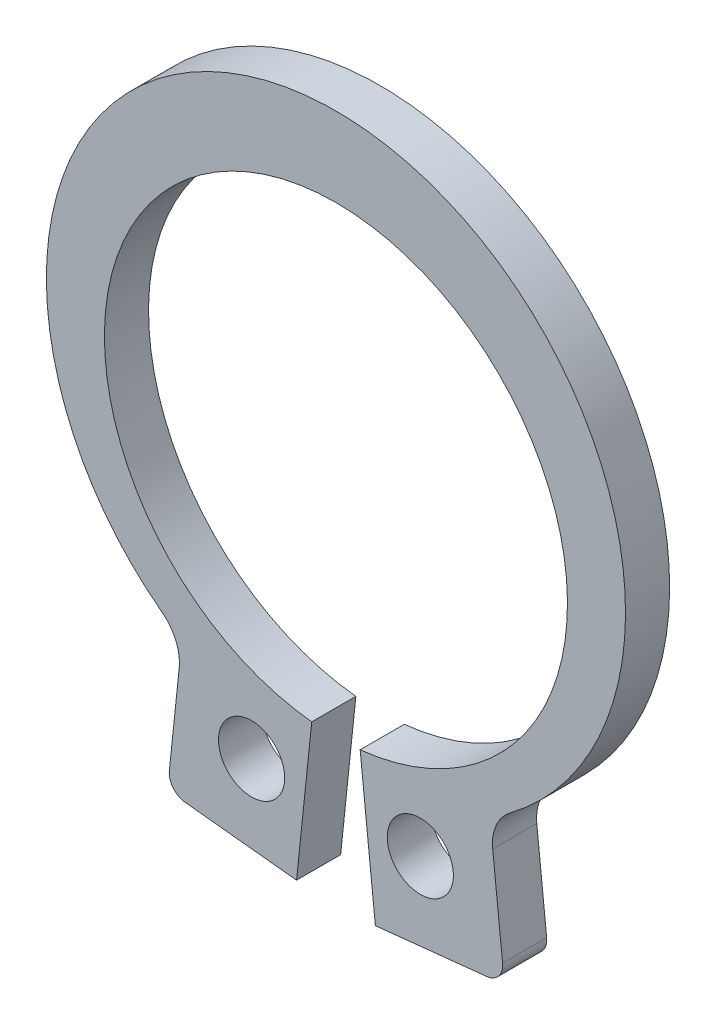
from build123d import *

# Parameters (mm, degrees)
BASE_EXTRUSION_DEPTH    = 1
ENL_V_MAT_EXTRU_1_DEPTH = 1
ENL_V_MAT_EXTRU_2_DEPTH = 1


with BuildPart() as part:
    # Esquisse1 → Base-Extrusion (new body)
    with BuildSketch(Plane.XY):
        with BuildLine():
            Line((-0.548774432, -5.221239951), (-0.893718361, -8.503162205))
            Line((-0.893718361, -8.503162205), (-3.422213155, -8.237406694))
            ThreePointArc((-3.422213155, -8.237406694), (-3.691260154, -8.091326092), (-3.778210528, -7.79778655))
            Line((-3.778210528, -7.79778655), (-3.554189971, -5.666373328))
            ThreePointArc((-3.554189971, -5.666373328), (-3.6318033, -5.162747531), (-3.947503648, -4.762752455))
            ThreePointArc((-3.947503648, -4.762752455), (0, 7.05), (3.947503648, -4.762752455))
            ThreePointArc((3.947503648, -4.762752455), (3.6318033, -5.162747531), (3.554189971, -5.666373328))
            Line((3.554189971, -5.666373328), (3.778210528, -7.79778655))
            ThreePointArc((3.778210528, -7.79778655), (3.691260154, -8.091326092), (3.422213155, -8.237406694))
            Line((3.422213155, -8.237406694), (0.893718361, -8.503162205))
            Line((0.893718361, -8.503162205), (0.548774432, -5.221239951))
            ThreePointArc((0.548774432, -5.221239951), (0, 5.25), (-0.548774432, -5.221239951))
        make_face()
    extrude(amount=BASE_EXTRUSION_DEPTH)

    # Esquisse2 → Enl_v. mat.-Extru.1 (cut)
    with BuildSketch(Plane.XY):
        with BuildLine():
            ThreePointArc((2.662993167, -6.629514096), (1.912993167, -7.379514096), (1.162993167, -6.629514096))
            ThreePointArc((1.162993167, -6.629514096), (1.912993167, -5.879514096), (2.662993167, -6.629514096))
        make_face()
    extrude(amount=ENL_V_MAT_EXTRU_1_DEPTH, mode=Mode.SUBTRACT)

    # Esquisse3 → Enl_v. mat.-Extru.2 (cut)
    with BuildSketch(Plane.XY):
        with BuildLine():
            ThreePointArc((-2.662993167, -6.629514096), (-1.912993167, -5.879514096), (-1.162993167, -6.629514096))
            ThreePointArc((-1.162993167, -6.629514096), (-1.912993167, -7.379514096), (-2.662993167, -6.629514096))
        make_face()
    extrude(amount=ENL_V_MAT_EXTRU_2_DEPTH, mode=Mode.SUBTRACT)


solid = part.part
